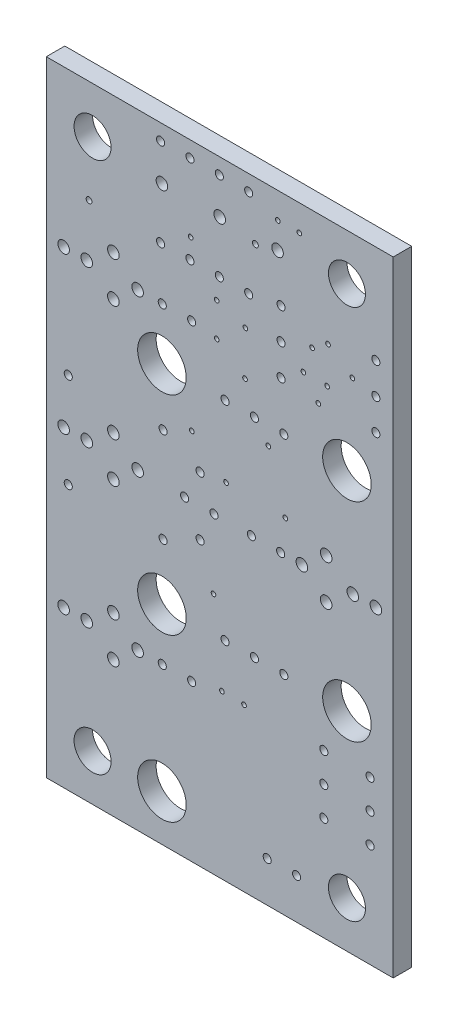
from build123d import *

# Parameters (mm, degrees)
MODEL_W            = 30
MODEL_H            = 54
MODEL_R            = 2.1
MODEL_R_2          = 0.35
MODEL_R_3          = 0.2
MODEL_R_4          = 0.5
MODEL_R_5          = 0.25
MODEL_R_6          = 0.254
MODEL_R_7          = 1.6
BOSS_EXTRU_1_DEPTH = 1.6


with BuildPart() as part:
    # Model → Boss.-Extru.1 (new body)
    with BuildSketch(Plane.XY):
        with Locations((15, 27)):
            Rectangle(MODEL_W, MODEL_H)
        with Locations((9.99998, 4.0005)):
            Circle(MODEL_R, mode=Mode.SUBTRACT)
        with Locations((9.99998, 18.00098)):
            Circle(MODEL_R, mode=Mode.SUBTRACT)
        with Locations((25.99944, 18.00098)):
            Circle(MODEL_R, mode=Mode.SUBTRACT)
        with Locations((9.99998, 35.99942)):
            Circle(MODEL_R, mode=Mode.SUBTRACT)
        with Locations((25.99944, 35.99942)):
            Circle(MODEL_R, mode=Mode.SUBTRACT)
        with Locations((10.10031, 22.90064)):
            Circle(MODEL_R_2, mode=Mode.SUBTRACT)
        with Locations((19.2024, 34.44748)):
            Circle(MODEL_R_3, mode=Mode.SUBTRACT)
        with Locations((23.99919, 8.96112)):
            Circle(MODEL_R_2, mode=Mode.SUBTRACT)
        with Locations((28.00046, 14.04112)):
            Circle(MODEL_R_2, mode=Mode.SUBTRACT)
        with Locations((27.99919, 8.96112)):
            Circle(MODEL_R_2, mode=Mode.SUBTRACT)
        with Locations((7.8994, 27.0002)):
            Circle(MODEL_R_4, mode=Mode.SUBTRACT)
        with Locations((12.57046, 40.5003)):
            Circle(MODEL_R_2, mode=Mode.SUBTRACT)
        with Locations((21.64461, 3.50012)):
            Circle(MODEL_R_2, mode=Mode.SUBTRACT)
        with Locations((19.10461, 3.50012)):
            Circle(MODEL_R_2, mode=Mode.SUBTRACT)
        with Locations((17.99971, 18.00098)):
            Circle(MODEL_R_2, mode=Mode.SUBTRACT)
        with Locations((15.45971, 18.00098)):
            Circle(MODEL_R_2, mode=Mode.SUBTRACT)
        with Locations((26.50134, 27.0002)):
            Circle(MODEL_R_4, mode=Mode.SUBTRACT)
        with Locations((24.20112, 25.25026)):
            Circle(MODEL_R_4, mode=Mode.SUBTRACT)
        with Locations((20.27047, 27.0002)):
            Circle(MODEL_R_2, mode=Mode.SUBTRACT)
        with Locations((12.58316, 32.26816)):
            Circle(MODEL_R_3, mode=Mode.SUBTRACT)
        with Locations((10.02919, 13.5001)):
            Circle(MODEL_R_2, mode=Mode.SUBTRACT)
        with Locations((1.4986, 13.50137)):
            Circle(MODEL_R_4, mode=Mode.SUBTRACT)
        with Locations((3.4986, 13.50137)):
            Circle(MODEL_R_4, mode=Mode.SUBTRACT)
        with Locations((7.8986, 13.50137)):
            Circle(MODEL_R_4, mode=Mode.SUBTRACT)
        with Locations((5.7986, 11.75137)):
            Circle(MODEL_R_4, mode=Mode.SUBTRACT)
        with Locations((5.7986, 15.25137)):
            Circle(MODEL_R_4, mode=Mode.SUBTRACT)
        with Locations((10.10031, 31.09976)):
            Circle(MODEL_R_2, mode=Mode.SUBTRACT)
        with Locations((17.18564, 38.48354)):
            Circle(MODEL_R_3, mode=Mode.SUBTRACT)
        with Locations((1.89992, 22.89937)):
            Circle(MODEL_R_2, mode=Mode.SUBTRACT)
        with Locations((10.03046, 40.5003)):
            Circle(MODEL_R_2, mode=Mode.SUBTRACT)
        with Locations((1.89992, 31.09976)):
            Circle(MODEL_R_2, mode=Mode.SUBTRACT)
        with Locations((1.4994, 27.0002)):
            Circle(MODEL_R_4, mode=Mode.SUBTRACT)
        with Locations((3.4994, 27.0002)):
            Circle(MODEL_R_4, mode=Mode.SUBTRACT)
        with Locations((5.7994, 25.2502)):
            Circle(MODEL_R_4, mode=Mode.SUBTRACT)
        with Locations((5.7994, 28.7502)):
            Circle(MODEL_R_4, mode=Mode.SUBTRACT)
        with Locations((11.95959, 27.0002)):
            Circle(MODEL_R_2, mode=Mode.SUBTRACT)
        with Locations((14.49959, 27.0002)):
            Circle(MODEL_R_2, mode=Mode.SUBTRACT)
        with Locations((15.45971, 35.99942)):
            Circle(MODEL_R_2, mode=Mode.SUBTRACT)
        with Locations((28.50007, 42.79902)):
            Circle(MODEL_R_2, mode=Mode.SUBTRACT)
        with Locations((28.50007, 40.09902)):
            Circle(MODEL_R_2, mode=Mode.SUBTRACT)
        with Locations((12.42314, 45.00372)):
            Circle(MODEL_R_2, mode=Mode.SUBTRACT)
        with Locations((28.50007, 45.49902)):
            Circle(MODEL_R_2, mode=Mode.SUBTRACT)
        with Locations((14.96314, 45.00372)):
            Circle(MODEL_R_2, mode=Mode.SUBTRACT)
        with Locations((17.50314, 45.00372)):
            Circle(MODEL_R_2, mode=Mode.SUBTRACT)
        with Locations((14.96314, 52.62372)):
            Circle(MODEL_R_2, mode=Mode.SUBTRACT)
        with Locations((12.42314, 52.62372)):
            Circle(MODEL_R_2, mode=Mode.SUBTRACT)
        with Locations((9.88314, 52.62372)):
            Circle(MODEL_R_2, mode=Mode.SUBTRACT)
        with Locations((14.99998, 49.49952)):
            Circle(MODEL_R_4, mode=Mode.SUBTRACT)
        with Locations((24.36368, 44.65066)):
            Circle(MODEL_R_3, mode=Mode.SUBTRACT)
        with Locations((1.4986, 40.50157)):
            Circle(MODEL_R_4, mode=Mode.SUBTRACT)
        with Locations((28.50134, 27.0002)):
            Circle(MODEL_R_4, mode=Mode.SUBTRACT)
        with Locations((7.8986, 40.50157)):
            Circle(MODEL_R_4, mode=Mode.SUBTRACT)
        with Locations((3.4986, 40.50157)):
            Circle(MODEL_R_4, mode=Mode.SUBTRACT)
        with Locations((5.7986, 38.75157)):
            Circle(MODEL_R_4, mode=Mode.SUBTRACT)
        with Locations((5.7986, 42.25157)):
            Circle(MODEL_R_4, mode=Mode.SUBTRACT)
        with Locations((20.02448, 51.74742)):
            Circle(MODEL_R_3, mode=Mode.SUBTRACT)
        with Locations((13.29944, 24.4602)):
            Circle(MODEL_R_2, mode=Mode.SUBTRACT)
        with Locations((24.00046, 14.04112)):
            Circle(MODEL_R_2, mode=Mode.SUBTRACT)
        with Locations((20.30095, 45.49902)):
            Circle(MODEL_R_2, mode=Mode.SUBTRACT)
        with Locations((12.49045, 46.73346)):
            Circle(MODEL_R_3, mode=Mode.SUBTRACT)
        with Locations((3.69697, 45.0977)):
            Circle(MODEL_R_5, mode=Mode.SUBTRACT)
        with Locations((12.56919, 13.5001)):
            Circle(MODEL_R_2, mode=Mode.SUBTRACT)
        with Locations((17.21866, 42.3037)):
            Circle(MODEL_R_3, mode=Mode.SUBTRACT)
        with Locations((20.29968, 42.799)):
            Circle(MODEL_R_2, mode=Mode.SUBTRACT)
        with Locations((17.73047, 27.0002)):
            Circle(MODEL_R_2, mode=Mode.SUBTRACT)
        with Locations((15.54353, 29.8831)):
            Circle(MODEL_R_3, mode=Mode.SUBTRACT)
        with Locations((20.30095, 40.09898)):
            Circle(MODEL_R_2, mode=Mode.SUBTRACT)
        with Locations((27.99969, 11.50112)):
            Circle(MODEL_R_2, mode=Mode.SUBTRACT)
        with Locations((26.47315, 43.18)):
            Circle(MODEL_R_3, mode=Mode.SUBTRACT)
        with Locations((21.87448, 51.74742)):
            Circle(MODEL_R_3, mode=Mode.SUBTRACT)
        with Locations((17.50314, 52.62372)):
            Circle(MODEL_R_2, mode=Mode.SUBTRACT)
        with Locations((15.1892, 14.07668)):
            Circle(MODEL_R_3, mode=Mode.SUBTRACT)
        with Locations((14.45768, 21.00072)):
            Circle(MODEL_R_3, mode=Mode.SUBTRACT)
        with Locations((23.99919, 11.50112)):
            Circle(MODEL_R_2, mode=Mode.SUBTRACT)
        with Locations((17.09928, 14.01318)):
            Circle(MODEL_R_3, mode=Mode.SUBTRACT)
        with Locations((20.53971, 18.00098)):
            Circle(MODEL_R_2, mode=Mode.SUBTRACT)
        with Locations((23.52421, 39.80434)):
            Circle(MODEL_R_3, mode=Mode.SUBTRACT)
        with Locations((22.10181, 27.0002)):
            Circle(MODEL_R_4, mode=Mode.SUBTRACT)
        with Locations((18.08226, 48.99914)):
            Circle(MODEL_R_6, mode=Mode.SUBTRACT)
        with Locations((22.23262, 41.49598)):
            Circle(MODEL_R_3, mode=Mode.SUBTRACT)
        with Locations((14.73835, 40.2336)):
            Circle(MODEL_R_3, mode=Mode.SUBTRACT)
        with Locations((14.73835, 43.13174)):
            Circle(MODEL_R_3, mode=Mode.SUBTRACT)
        with Locations((9.99998, 49.49952)):
            Circle(MODEL_R_4, mode=Mode.SUBTRACT)
        with Locations((17.99971, 35.99942)):
            Circle(MODEL_R_2, mode=Mode.SUBTRACT)
        with Locations((9.88314, 45.00372)):
            Circle(MODEL_R_2, mode=Mode.SUBTRACT)
        with Locations((19.99996, 49.49952)):
            Circle(MODEL_R_4, mode=Mode.SUBTRACT)
        with Locations((24.2824, 41.46804)):
            Circle(MODEL_R_3, mode=Mode.SUBTRACT)
        with Locations((22.98192, 43.69054)):
            Circle(MODEL_R_3, mode=Mode.SUBTRACT)
        with Locations((20.67179, 29.78912)):
            Circle(MODEL_R_3, mode=Mode.SUBTRACT)
        with Locations((24.20112, 28.75026)):
            Circle(MODEL_R_4, mode=Mode.SUBTRACT)
        with Locations((13.29944, 29.5402)):
            Circle(MODEL_R_2, mode=Mode.SUBTRACT)
        with Locations((20.53971, 35.99942)):
            Circle(MODEL_R_2, mode=Mode.SUBTRACT)
        with Locations((4, 50)):
            Circle(MODEL_R_7, mode=Mode.SUBTRACT)
        with Locations(Location((26, 50, 0), (0, 0, 180))):
            Circle(MODEL_R_7, mode=Mode.SUBTRACT)
        with Locations(Location((4, 4, 0), (0, 0, 180))):
            Circle(MODEL_R_7, mode=Mode.SUBTRACT)
        with Locations((26, 4)):
            Circle(MODEL_R_7, mode=Mode.SUBTRACT)
    extrude(amount=BOSS_EXTRU_1_DEPTH)


solid = part.part
